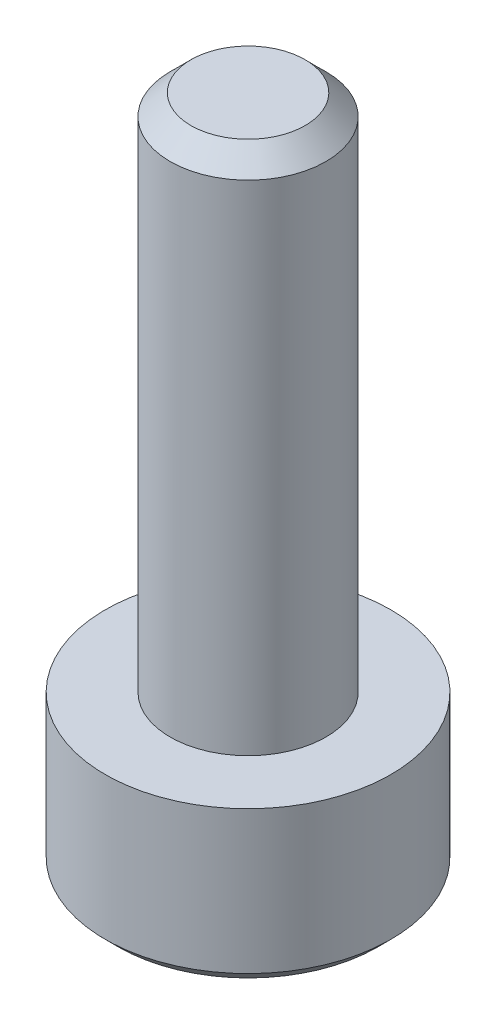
ISO-10303-21;
HEADER;
FILE_DESCRIPTION(('STEP AP214'),'2;1');
FILE_NAME('part.step','',(''),(''),'','','');
FILE_SCHEMA(('AUTOMOTIVE_DESIGN { 1 0 10303 214 1 1 1 1 }'));
ENDSEC;
DATA;
#1=APPLICATION_CONTEXT('core data for automotive mechanical design processes');
#2=APPLICATION_PROTOCOL_DEFINITION('international standard','automotive_design',2000,#1);
#3=PRODUCT_CONTEXT('',#1,'mechanical');
#4=PRODUCT('Part','Part','',(#3));
#5=PRODUCT_RELATED_PRODUCT_CATEGORY('part','',(#4));
#6=PRODUCT_DEFINITION_FORMATION('','',#4);
#7=PRODUCT_DEFINITION_CONTEXT('part definition',#1,'design');
#8=PRODUCT_DEFINITION('design','',#6,#7);
#9=PRODUCT_DEFINITION_SHAPE('','',#8);
#10=(LENGTH_UNIT() NAMED_UNIT(*) SI_UNIT(.MILLI.,.METRE.));
#11=(NAMED_UNIT(*) PLANE_ANGLE_UNIT() SI_UNIT($,.RADIAN.));
#12=(NAMED_UNIT(*) SI_UNIT($,.STERADIAN.) SOLID_ANGLE_UNIT());
#13=UNCERTAINTY_MEASURE_WITH_UNIT(LENGTH_MEASURE(1.E-05),#10,'distance_accuracy_value','');
#14=(GEOMETRIC_REPRESENTATION_CONTEXT(3) GLOBAL_UNCERTAINTY_ASSIGNED_CONTEXT((#13)) GLOBAL_UNIT_ASSIGNED_CONTEXT((#10,
#11,#12)) REPRESENTATION_CONTEXT('',''));
#15=CARTESIAN_POINT('',(0.,0.,0.));
#16=DIRECTION('',(0.,0.,1.));
#17=DIRECTION('',(1.,0.,0.));
#18=AXIS2_PLACEMENT_3D('',#15,#16,#17);
#19=CARTESIAN_POINT('',(-2.75,2.99999999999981,4.16333634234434E-13));
#20=DIRECTION('',(0.,1.,0.));
#21=DIRECTION('',(0.,0.,1.));
#22=AXIS2_PLACEMENT_3D('',#19,#20,#21);
#23=PLANE('',#22);
#24=CARTESIAN_POINT('',(0.,2.99999999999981,0.));
#25=DIRECTION('',(0.,-1.,0.));
#26=DIRECTION('',(0.,0.,-1.));
#27=AXIS2_PLACEMENT_3D('',#24,#25,#26);
#28=CIRCLE('',#27,1.5);
#29=CARTESIAN_POINT('',(0.,2.99999999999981,-1.5));
#30=VERTEX_POINT('',#29);
#31=EDGE_CURVE('E150',#30,#30,#28,.T.);
#32=ORIENTED_EDGE('',*,*,#31,.T.);
#33=EDGE_LOOP('',(#32));
#34=FACE_BOUND('',#33,.T.);
#35=CARTESIAN_POINT('',(0.,2.99999999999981,0.));
#36=DIRECTION('',(0.,-1.,0.));
#37=DIRECTION('',(0.,0.,-1.));
#38=AXIS2_PLACEMENT_3D('',#35,#36,#37);
#39=CIRCLE('',#38,2.75);
#40=CARTESIAN_POINT('',(0.,2.99999999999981,-2.75000000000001));
#41=VERTEX_POINT('',#40);
#42=EDGE_CURVE('E147',#41,#41,#39,.T.);
#43=ORIENTED_EDGE('',*,*,#42,.F.);
#44=EDGE_LOOP('',(#43));
#45=FACE_BOUND('',#44,.T.);
#46=ADVANCED_FACE('F40',(#34,#45),#23,.T.);
#47=CARTESIAN_POINT('',(0.,-0.731448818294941,0.));
#48=DIRECTION('',(0.,-1.,0.));
#49=DIRECTION('',(0.,0.,-1.));
#50=AXIS2_PLACEMENT_3D('',#47,#48,#49);
#51=CYLINDRICAL_SURFACE('',#50,1.5);
#52=CARTESIAN_POINT('',(-1.80411241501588E-13,12.5999999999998,0.));
#53=DIRECTION('',(0.,1.,0.));
#54=DIRECTION('',(0.,0.,1.));
#55=AXIS2_PLACEMENT_3D('',#52,#53,#54);
#56=CIRCLE('',#55,1.5);
#57=CARTESIAN_POINT('',(-1.86052562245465E-13,12.5999999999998,1.5));
#58=VERTEX_POINT('',#57);
#59=EDGE_CURVE('E153',#58,#58,#56,.F.);
#60=ORIENTED_EDGE('',*,*,#59,.T.);
#61=EDGE_LOOP('',(#60));
#62=FACE_BOUND('',#61,.T.);
#63=ORIENTED_EDGE('',*,*,#31,.F.);
#64=EDGE_LOOP('',(#63));
#65=FACE_BOUND('',#64,.T.);
#66=ADVANCED_FACE('F176',(#62,#65),#51,.T.);
#67=CARTESIAN_POINT('',(-1.50000000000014,12.9999999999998,0.));
#68=DIRECTION('',(0.,1.,0.));
#69=DIRECTION('',(0.,0.,1.));
#70=AXIS2_PLACEMENT_3D('',#67,#68,#69);
#71=PLANE('',#70);
#72=CARTESIAN_POINT('',(-1.76941794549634E-13,12.9999999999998,0.));
#73=DIRECTION('',(0.,1.,0.));
#74=DIRECTION('',(0.,0.,1.));
#75=AXIS2_PLACEMENT_3D('',#72,#73,#74);
#76=CIRCLE('',#75,1.1);
#77=CARTESIAN_POINT('',(-1.81078763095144E-13,12.9999999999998,1.1));
#78=VERTEX_POINT('',#77);
#79=EDGE_CURVE('E156',#78,#78,#76,.T.);
#80=ORIENTED_EDGE('',*,*,#79,.T.);
#81=EDGE_LOOP('',(#80));
#82=FACE_BOUND('',#81,.T.);
#83=ADVANCED_FACE('F181',(#82),#71,.T.);
#84=CARTESIAN_POINT('',(0.,-1.94289029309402E-13,0.));
#85=DIRECTION('',(0.,-1.,0.));
#86=DIRECTION('',(0.,0.,-1.));
#87=AXIS2_PLACEMENT_3D('',#84,#85,#86);
#88=PLANE('',#87);
#89=CARTESIAN_POINT('',(0.,-1.94289029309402E-13,0.));
#90=DIRECTION('',(0.,-1.,0.));
#91=DIRECTION('',(0.,0.,-1.));
#92=AXIS2_PLACEMENT_3D('',#89,#90,#91);
#93=CIRCLE('',#92,2.5);
#94=CARTESIAN_POINT('',(0.,-1.94289029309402E-13,-2.5));
#95=VERTEX_POINT('',#94);
#96=EDGE_CURVE('E47',#95,#95,#93,.T.);
#97=ORIENTED_EDGE('',*,*,#96,.T.);
#98=EDGE_LOOP('',(#97));
#99=FACE_BOUND('',#98,.T.);
#100=DIRECTION('',(0.499999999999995,0.,0.866025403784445));
#101=VECTOR('',#100,1.);
#102=CARTESIAN_POINT('',(0.829156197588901,0.,-1.25));
#103=LINE('',#102,#101);
#104=CARTESIAN_POINT('',(0.829156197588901,0.,-1.25));
#105=VERTEX_POINT('',#104);
#106=CARTESIAN_POINT('',(1.55084403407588,-1.94289029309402E-13,0.));
#107=VERTEX_POINT('',#106);
#108=EDGE_CURVE('E54',#105,#107,#103,.T.);
#109=ORIENTED_EDGE('',*,*,#108,.F.);
#110=DIRECTION('',(1.,0.,0.));
#111=VECTOR('',#110,1.);
#112=CARTESIAN_POINT('',(-0.614219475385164,0.,-1.25));
#113=LINE('',#112,#111);
#114=CARTESIAN_POINT('',(-0.614219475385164,0.,-1.25));
#115=VERTEX_POINT('',#114);
#116=EDGE_CURVE('E123',#115,#105,#113,.T.);
#117=ORIENTED_EDGE('',*,*,#116,.F.);
#118=DIRECTION('',(0.500000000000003,0.,-0.866025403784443));
#119=VECTOR('',#118,1.);
#120=CARTESIAN_POINT('',(-1.33590731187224,-1.94289029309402E-13,0.));
#121=LINE('',#120,#119);
#122=CARTESIAN_POINT('',(-1.33590731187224,-1.94289029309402E-13,0.));
#123=VERTEX_POINT('',#122);
#124=EDGE_CURVE('E117',#123,#115,#121,.T.);
#125=ORIENTED_EDGE('',*,*,#124,.F.);
#126=DIRECTION('',(-0.499999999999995,0.,-0.866025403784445));
#127=VECTOR('',#126,1.);
#128=CARTESIAN_POINT('',(-0.614219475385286,-1.94289029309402E-13,1.25));
#129=LINE('',#128,#127);
#130=CARTESIAN_POINT('',(-0.614219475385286,-1.94289029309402E-13,1.25));
#131=VERTEX_POINT('',#130);
#132=EDGE_CURVE('E115',#131,#123,#129,.T.);
#133=ORIENTED_EDGE('',*,*,#132,.F.);
#134=DIRECTION('',(-1.,0.,0.));
#135=VECTOR('',#134,1.);
#136=CARTESIAN_POINT('',(0.829156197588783,-1.94289029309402E-13,1.25));
#137=LINE('',#136,#135);
#138=CARTESIAN_POINT('',(0.829156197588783,-1.94289029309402E-13,1.25));
#139=VERTEX_POINT('',#138);
#140=EDGE_CURVE('E97',#139,#131,#137,.T.);
#141=ORIENTED_EDGE('',*,*,#140,.F.);
#142=DIRECTION('',(-0.500000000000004,0.,0.866025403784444));
#143=VECTOR('',#142,1.);
#144=CARTESIAN_POINT('',(1.55084403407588,-1.94289029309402E-13,0.));
#145=LINE('',#144,#143);
#146=EDGE_CURVE('E108',#107,#139,#145,.T.);
#147=ORIENTED_EDGE('',*,*,#146,.F.);
#148=EDGE_LOOP('',(#109,#117,#125,#133,#141,#147));
#149=FACE_BOUND('',#148,.T.);
#150=ADVANCED_FACE('F112',(#99,#149),#88,.T.);
#151=CARTESIAN_POINT('',(0.,-0.731448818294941,0.));
#152=DIRECTION('',(0.,-1.,0.));
#153=DIRECTION('',(0.,0.,-1.));
#154=AXIS2_PLACEMENT_3D('',#151,#152,#153);
#155=CYLINDRICAL_SURFACE('',#154,2.75);
#156=CARTESIAN_POINT('',(0.,0.249999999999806,0.));
#157=DIRECTION('',(0.,-1.,0.));
#158=DIRECTION('',(0.,0.,-1.));
#159=AXIS2_PLACEMENT_3D('',#156,#157,#158);
#160=CIRCLE('',#159,2.75);
#161=CARTESIAN_POINT('',(0.,0.249999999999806,-2.75000000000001));
#162=VERTEX_POINT('',#161);
#163=EDGE_CURVE('E12',#162,#162,#160,.F.);
#164=ORIENTED_EDGE('',*,*,#163,.T.);
#165=EDGE_LOOP('',(#164));
#166=FACE_BOUND('',#165,.T.);
#167=ORIENTED_EDGE('',*,*,#42,.T.);
#168=EDGE_LOOP('',(#167));
#169=FACE_BOUND('',#168,.T.);
#170=ADVANCED_FACE('F187',(#166,#169),#155,.T.);
#171=CARTESIAN_POINT('',(-1.80411241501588E-13,12.5999999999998,0.));
#172=DIRECTION('',(0.,-1.,0.));
#173=DIRECTION('',(0.,0.,-1.));
#174=AXIS2_PLACEMENT_3D('',#171,#172,#173);
#175=CONICAL_SURFACE('',#174,1.5,0.785398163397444);
#176=ORIENTED_EDGE('',*,*,#79,.F.);
#177=EDGE_LOOP('',(#176));
#178=FACE_BOUND('',#177,.T.);
#179=ORIENTED_EDGE('',*,*,#59,.F.);
#180=EDGE_LOOP('',(#179));
#181=FACE_BOUND('',#180,.T.);
#182=ADVANCED_FACE('F189',(#178,#181),#175,.T.);
#183=CARTESIAN_POINT('',(0.829156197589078,2.50000000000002,-1.25));
#184=DIRECTION('',(0.866025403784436,0.,-0.5));
#185=DIRECTION('',(-0.499999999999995,0.,-0.866025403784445));
#186=AXIS2_PLACEMENT_3D('',#183,#184,#185);
#187=PLANE('',#186);
#188=DIRECTION('',(0.,-1.,0.));
#189=VECTOR('',#188,1.);
#190=CARTESIAN_POINT('',(0.829156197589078,2.50000000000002,-1.25));
#191=LINE('',#190,#189);
#192=CARTESIAN_POINT('',(0.829156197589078,2.50000000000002,-1.25));
#193=VERTEX_POINT('',#192);
#194=EDGE_CURVE('E61',#193,#105,#191,.T.);
#195=ORIENTED_EDGE('',*,*,#194,.T.);
#196=ORIENTED_EDGE('',*,*,#108,.T.);
#197=DIRECTION('',(0.,-1.,0.));
#198=VECTOR('',#197,1.);
#199=CARTESIAN_POINT('',(1.55084403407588,2.49999999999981,0.));
#200=LINE('',#199,#198);
#201=CARTESIAN_POINT('',(1.55084403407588,2.49999999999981,0.));
#202=VERTEX_POINT('',#201);
#203=EDGE_CURVE('E105',#202,#107,#200,.T.);
#204=ORIENTED_EDGE('',*,*,#203,.F.);
#205=DIRECTION('',(0.499999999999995,0.,0.866025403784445));
#206=VECTOR('',#205,1.);
#207=CARTESIAN_POINT('',(0.829156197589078,2.50000000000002,-1.25));
#208=LINE('',#207,#206);
#209=EDGE_CURVE('E125',#193,#202,#208,.T.);
#210=ORIENTED_EDGE('',*,*,#209,.F.);
#211=EDGE_LOOP('',(#195,#196,#204,#210));
#212=FACE_BOUND('',#211,.T.);
#213=ADVANCED_FACE('F196',(#212),#187,.F.);
#214=CARTESIAN_POINT('',(-0.614219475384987,2.50000000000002,-1.25));
#215=DIRECTION('',(0.,0.,-1.));
#216=DIRECTION('',(-1.,0.,0.));
#217=AXIS2_PLACEMENT_3D('',#214,#215,#216);
#218=PLANE('',#217);
#219=DIRECTION('',(0.,-1.,0.));
#220=VECTOR('',#219,1.);
#221=CARTESIAN_POINT('',(-0.614219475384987,2.50000000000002,-1.25));
#222=LINE('',#221,#220);
#223=CARTESIAN_POINT('',(-0.614219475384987,2.50000000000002,-1.25));
#224=VERTEX_POINT('',#223);
#225=EDGE_CURVE('E144',#224,#115,#222,.T.);
#226=ORIENTED_EDGE('',*,*,#225,.T.);
#227=ORIENTED_EDGE('',*,*,#116,.T.);
#228=ORIENTED_EDGE('',*,*,#194,.F.);
#229=DIRECTION('',(1.,0.,0.));
#230=VECTOR('',#229,1.);
#231=CARTESIAN_POINT('',(-0.614219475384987,2.50000000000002,-1.25));
#232=LINE('',#231,#230);
#233=EDGE_CURVE('E137',#224,#193,#232,.T.);
#234=ORIENTED_EDGE('',*,*,#233,.F.);
#235=EDGE_LOOP('',(#226,#227,#228,#234));
#236=FACE_BOUND('',#235,.T.);
#237=ADVANCED_FACE('F235',(#236),#218,.F.);
#238=CARTESIAN_POINT('',(-1.33590731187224,2.49999999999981,0.));
#239=DIRECTION('',(-0.866025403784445,0.,-0.499999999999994));
#240=DIRECTION('',(-0.500000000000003,0.,0.866025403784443));
#241=AXIS2_PLACEMENT_3D('',#238,#239,#240);
#242=PLANE('',#241);
#243=DIRECTION('',(0.,-1.,0.));
#244=VECTOR('',#243,1.);
#245=CARTESIAN_POINT('',(-1.33590731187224,2.49999999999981,0.));
#246=LINE('',#245,#244);
#247=CARTESIAN_POINT('',(-1.33590731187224,2.49999999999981,0.));
#248=VERTEX_POINT('',#247);
#249=EDGE_CURVE('E142',#248,#123,#246,.T.);
#250=ORIENTED_EDGE('',*,*,#249,.T.);
#251=ORIENTED_EDGE('',*,*,#124,.T.);
#252=ORIENTED_EDGE('',*,*,#225,.F.);
#253=DIRECTION('',(0.500000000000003,0.,-0.866025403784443));
#254=VECTOR('',#253,1.);
#255=CARTESIAN_POINT('',(-1.33590731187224,2.49999999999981,0.));
#256=LINE('',#255,#254);
#257=EDGE_CURVE('E134',#248,#224,#256,.T.);
#258=ORIENTED_EDGE('',*,*,#257,.F.);
#259=EDGE_LOOP('',(#250,#251,#252,#258));
#260=FACE_BOUND('',#259,.T.);
#261=ADVANCED_FACE('F244',(#260),#242,.F.);
#262=CARTESIAN_POINT('',(-0.614219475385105,2.49999999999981,1.25));
#263=DIRECTION('',(-0.866025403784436,0.,0.5));
#264=DIRECTION('',(0.499999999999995,0.,0.866025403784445));
#265=AXIS2_PLACEMENT_3D('',#262,#263,#264);
#266=PLANE('',#265);
#267=DIRECTION('',(0.,-1.,0.));
#268=VECTOR('',#267,1.);
#269=CARTESIAN_POINT('',(-0.614219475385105,2.49999999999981,1.25));
#270=LINE('',#269,#268);
#271=CARTESIAN_POINT('',(-0.614219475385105,2.49999999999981,1.25));
#272=VERTEX_POINT('',#271);
#273=EDGE_CURVE('E104',#272,#131,#270,.T.);
#274=ORIENTED_EDGE('',*,*,#273,.T.);
#275=ORIENTED_EDGE('',*,*,#132,.T.);
#276=ORIENTED_EDGE('',*,*,#249,.F.);
#277=DIRECTION('',(-0.499999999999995,0.,-0.866025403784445));
#278=VECTOR('',#277,1.);
#279=CARTESIAN_POINT('',(-0.614219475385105,2.49999999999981,1.25));
#280=LINE('',#279,#278);
#281=EDGE_CURVE('E131',#272,#248,#280,.T.);
#282=ORIENTED_EDGE('',*,*,#281,.F.);
#283=EDGE_LOOP('',(#274,#275,#276,#282));
#284=FACE_BOUND('',#283,.T.);
#285=ADVANCED_FACE('F252',(#284),#266,.F.);
#286=CARTESIAN_POINT('',(0.829156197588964,2.49999999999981,1.25));
#287=DIRECTION('',(0.,0.,1.));
#288=DIRECTION('',(1.,0.,0.));
#289=AXIS2_PLACEMENT_3D('',#286,#287,#288);
#290=PLANE('',#289);
#291=DIRECTION('',(0.,-1.,0.));
#292=VECTOR('',#291,1.);
#293=CARTESIAN_POINT('',(0.829156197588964,2.49999999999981,1.25));
#294=LINE('',#293,#292);
#295=CARTESIAN_POINT('',(0.829156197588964,2.49999999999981,1.25));
#296=VERTEX_POINT('',#295);
#297=EDGE_CURVE('E93',#296,#139,#294,.T.);
#298=ORIENTED_EDGE('',*,*,#297,.T.);
#299=ORIENTED_EDGE('',*,*,#140,.T.);
#300=ORIENTED_EDGE('',*,*,#273,.F.);
#301=DIRECTION('',(-1.,0.,0.));
#302=VECTOR('',#301,1.);
#303=CARTESIAN_POINT('',(0.829156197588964,2.49999999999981,1.25));
#304=LINE('',#303,#302);
#305=EDGE_CURVE('E100',#296,#272,#304,.T.);
#306=ORIENTED_EDGE('',*,*,#305,.F.);
#307=EDGE_LOOP('',(#298,#299,#300,#306));
#308=FACE_BOUND('',#307,.T.);
#309=ADVANCED_FACE('F95',(#308),#290,.F.);
#310=CARTESIAN_POINT('',(1.55084403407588,2.49999999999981,0.));
#311=DIRECTION('',(0.866025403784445,0.,0.499999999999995));
#312=DIRECTION('',(0.500000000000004,0.,-0.866025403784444));
#313=AXIS2_PLACEMENT_3D('',#310,#311,#312);
#314=PLANE('',#313);
#315=DIRECTION('',(-0.500000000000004,0.,0.866025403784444));
#316=VECTOR('',#315,1.);
#317=CARTESIAN_POINT('',(1.55084403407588,2.49999999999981,0.));
#318=LINE('',#317,#316);
#319=EDGE_CURVE('E128',#202,#296,#318,.T.);
#320=ORIENTED_EDGE('',*,*,#319,.F.);
#321=ORIENTED_EDGE('',*,*,#203,.T.);
#322=ORIENTED_EDGE('',*,*,#146,.T.);
#323=ORIENTED_EDGE('',*,*,#297,.F.);
#324=EDGE_LOOP('',(#320,#321,#322,#323));
#325=FACE_BOUND('',#324,.T.);
#326=ADVANCED_FACE('F109',(#325),#314,.F.);
#327=CARTESIAN_POINT('',(0.829156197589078,2.50000000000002,-1.25));
#328=DIRECTION('',(0.,1.,0.));
#329=DIRECTION('',(0.,0.,1.));
#330=AXIS2_PLACEMENT_3D('',#327,#328,#329);
#331=PLANE('',#330);
#332=ORIENTED_EDGE('',*,*,#209,.T.);
#333=ORIENTED_EDGE('',*,*,#319,.T.);
#334=ORIENTED_EDGE('',*,*,#305,.T.);
#335=ORIENTED_EDGE('',*,*,#281,.T.);
#336=ORIENTED_EDGE('',*,*,#257,.T.);
#337=ORIENTED_EDGE('',*,*,#233,.T.);
#338=EDGE_LOOP('',(#332,#333,#334,#335,#336,#337));
#339=FACE_BOUND('',#338,.T.);
#340=ADVANCED_FACE('F164',(#339),#331,.F.);
#341=CARTESIAN_POINT('',(0.,-1.94289029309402E-13,0.));
#342=DIRECTION('',(0.,1.,0.));
#343=DIRECTION('',(0.,0.,1.));
#344=AXIS2_PLACEMENT_3D('',#341,#342,#343);
#345=CONICAL_SURFACE('',#344,2.5,0.785398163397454);
#346=ORIENTED_EDGE('',*,*,#163,.F.);
#347=EDGE_LOOP('',(#346));
#348=FACE_BOUND('',#347,.T.);
#349=ORIENTED_EDGE('',*,*,#96,.F.);
#350=EDGE_LOOP('',(#349));
#351=FACE_BOUND('',#350,.T.);
#352=ADVANCED_FACE('F162',(#348,#351),#345,.T.);
#353=CLOSED_SHELL('',(#46,#66,#83,#150,#170,#182,#213,#237,#261,#285,#309,#326,#340,#352));
#354=MANIFOLD_SOLID_BREP('B2',#353);
#355=ADVANCED_BREP_SHAPE_REPRESENTATION('',(#18,#354),#14);
#356=SHAPE_DEFINITION_REPRESENTATION(#9,#355);
ENDSEC;
END-ISO-10303-21;
